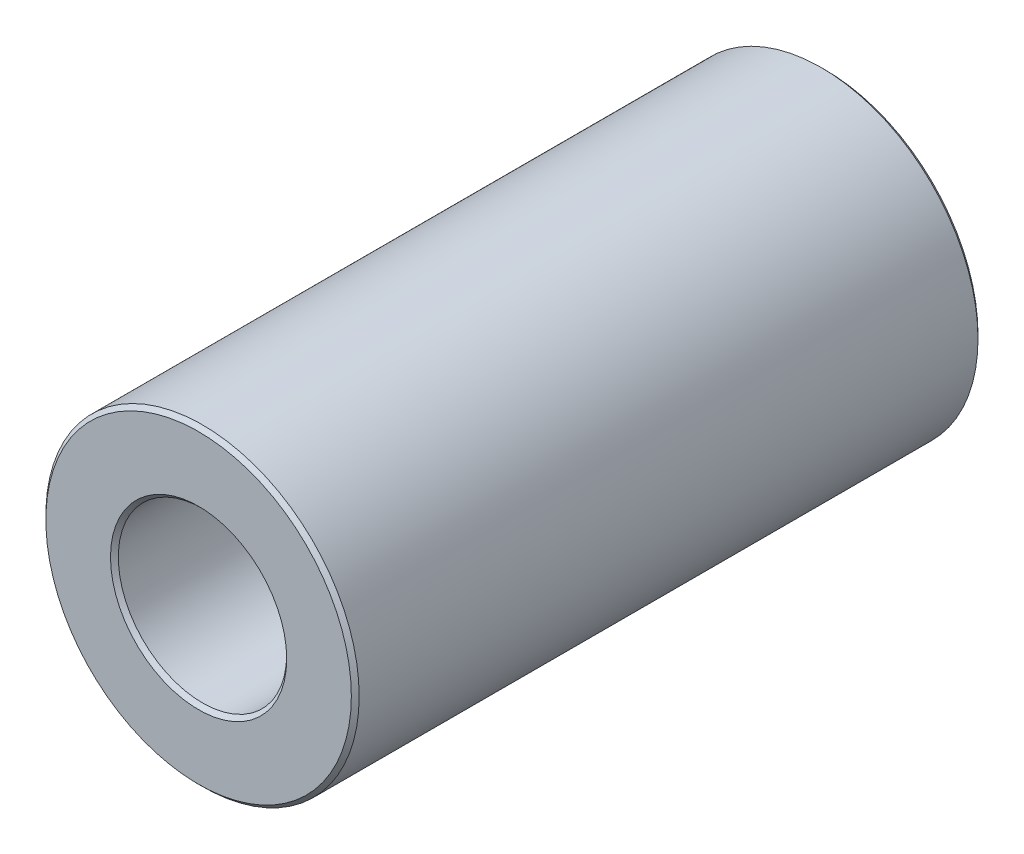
ISO-10303-21;
HEADER;
FILE_DESCRIPTION(('STEP AP214'),'2;1');
FILE_NAME('part.step','',(''),(''),'','','');
FILE_SCHEMA(('AUTOMOTIVE_DESIGN { 1 0 10303 214 1 1 1 1 }'));
ENDSEC;
DATA;
#1=APPLICATION_CONTEXT('core data for automotive mechanical design processes');
#2=APPLICATION_PROTOCOL_DEFINITION('international standard','automotive_design',2000,#1);
#3=PRODUCT_CONTEXT('',#1,'mechanical');
#4=PRODUCT('Part','Part','',(#3));
#5=PRODUCT_RELATED_PRODUCT_CATEGORY('part','',(#4));
#6=PRODUCT_DEFINITION_FORMATION('','',#4);
#7=PRODUCT_DEFINITION_CONTEXT('part definition',#1,'design');
#8=PRODUCT_DEFINITION('design','',#6,#7);
#9=PRODUCT_DEFINITION_SHAPE('','',#8);
#10=(LENGTH_UNIT() NAMED_UNIT(*) SI_UNIT(.MILLI.,.METRE.));
#11=(NAMED_UNIT(*) PLANE_ANGLE_UNIT() SI_UNIT($,.RADIAN.));
#12=(NAMED_UNIT(*) SI_UNIT($,.STERADIAN.) SOLID_ANGLE_UNIT());
#13=UNCERTAINTY_MEASURE_WITH_UNIT(LENGTH_MEASURE(1.E-05),#10,'distance_accuracy_value','');
#14=(GEOMETRIC_REPRESENTATION_CONTEXT(3) GLOBAL_UNCERTAINTY_ASSIGNED_CONTEXT((#13)) GLOBAL_UNIT_ASSIGNED_CONTEXT((#10,
#11,#12)) REPRESENTATION_CONTEXT('',''));
#15=CARTESIAN_POINT('',(0.,0.,0.));
#16=DIRECTION('',(0.,0.,1.));
#17=DIRECTION('',(1.,0.,0.));
#18=AXIS2_PLACEMENT_3D('',#15,#16,#17);
#19=CARTESIAN_POINT('',(0.,0.,8.));
#20=DIRECTION('',(0.,0.,1.));
#21=DIRECTION('',(1.,0.,0.));
#22=AXIS2_PLACEMENT_3D('',#19,#20,#21);
#23=PLANE('',#22);
#24=CARTESIAN_POINT('',(0.,0.,8.));
#25=DIRECTION('',(0.,0.,1.));
#26=DIRECTION('',(1.,0.,0.));
#27=AXIS2_PLACEMENT_3D('',#24,#25,#26);
#28=CIRCLE('',#27,2.25);
#29=CARTESIAN_POINT('',(2.25,0.,8.));
#30=VERTEX_POINT('',#29);
#31=EDGE_CURVE('E10',#30,#30,#28,.F.);
#32=ORIENTED_EDGE('',*,*,#31,.T.);
#33=EDGE_LOOP('',(#32));
#34=FACE_BOUND('',#33,.T.);
#35=CARTESIAN_POINT('',(0.,0.,8.));
#36=DIRECTION('',(0.,0.,1.));
#37=DIRECTION('',(1.,0.,0.));
#38=AXIS2_PLACEMENT_3D('',#35,#36,#37);
#39=CIRCLE('',#38,3.9);
#40=CARTESIAN_POINT('',(3.9,0.,8.));
#41=VERTEX_POINT('',#40);
#42=EDGE_CURVE('E45',#41,#41,#39,.T.);
#43=ORIENTED_EDGE('',*,*,#42,.T.);
#44=EDGE_LOOP('',(#43));
#45=FACE_BOUND('',#44,.T.);
#46=ADVANCED_FACE('F37',(#34,#45),#23,.T.);
#47=CARTESIAN_POINT('',(0.,0.,-8.));
#48=DIRECTION('',(0.,0.,1.));
#49=DIRECTION('',(1.,0.,0.));
#50=AXIS2_PLACEMENT_3D('',#47,#48,#49);
#51=PLANE('',#50);
#52=CARTESIAN_POINT('',(0.,0.,-8.));
#53=DIRECTION('',(0.,0.,1.));
#54=DIRECTION('',(1.,0.,0.));
#55=AXIS2_PLACEMENT_3D('',#52,#53,#54);
#56=CIRCLE('',#55,3.9);
#57=CARTESIAN_POINT('',(3.9,0.,-8.));
#58=VERTEX_POINT('',#57);
#59=EDGE_CURVE('E64',#58,#58,#56,.F.);
#60=ORIENTED_EDGE('',*,*,#59,.T.);
#61=EDGE_LOOP('',(#60));
#62=FACE_BOUND('',#61,.T.);
#63=CARTESIAN_POINT('',(0.,0.,-8.));
#64=DIRECTION('',(0.,0.,1.));
#65=DIRECTION('',(1.,0.,0.));
#66=AXIS2_PLACEMENT_3D('',#63,#64,#65);
#67=CIRCLE('',#66,2.25);
#68=CARTESIAN_POINT('',(2.25,0.,-8.));
#69=VERTEX_POINT('',#68);
#70=EDGE_CURVE('E67',#69,#69,#67,.T.);
#71=ORIENTED_EDGE('',*,*,#70,.T.);
#72=EDGE_LOOP('',(#71));
#73=FACE_BOUND('',#72,.T.);
#74=ADVANCED_FACE('F89',(#62,#73),#51,.F.);
#75=CARTESIAN_POINT('',(0.,0.,8.));
#76=DIRECTION('',(0.,0.,-1.));
#77=DIRECTION('',(-1.,0.,0.));
#78=AXIS2_PLACEMENT_3D('',#75,#76,#77);
#79=CYLINDRICAL_SURFACE('',#78,4.);
#80=CARTESIAN_POINT('',(0.,0.,-7.9));
#81=DIRECTION('',(0.,0.,1.));
#82=DIRECTION('',(1.,0.,0.));
#83=AXIS2_PLACEMENT_3D('',#80,#81,#82);
#84=CIRCLE('',#83,4.);
#85=CARTESIAN_POINT('',(4.,0.,-7.9));
#86=VERTEX_POINT('',#85);
#87=EDGE_CURVE('E71',#86,#86,#84,.T.);
#88=ORIENTED_EDGE('',*,*,#87,.T.);
#89=EDGE_LOOP('',(#88));
#90=FACE_BOUND('',#89,.T.);
#91=CARTESIAN_POINT('',(0.,0.,7.9));
#92=DIRECTION('',(0.,0.,1.));
#93=DIRECTION('',(1.,0.,0.));
#94=AXIS2_PLACEMENT_3D('',#91,#92,#93);
#95=CIRCLE('',#94,4.);
#96=CARTESIAN_POINT('',(4.,0.,7.9));
#97=VERTEX_POINT('',#96);
#98=EDGE_CURVE('E74',#97,#97,#95,.F.);
#99=ORIENTED_EDGE('',*,*,#98,.T.);
#100=EDGE_LOOP('',(#99));
#101=FACE_BOUND('',#100,.T.);
#102=ADVANCED_FACE('F78',(#90,#101),#79,.T.);
#103=CARTESIAN_POINT('',(0.,0.,8.));
#104=DIRECTION('',(0.,0.,-1.));
#105=DIRECTION('',(-1.,0.,0.));
#106=AXIS2_PLACEMENT_3D('',#103,#104,#105);
#107=CYLINDRICAL_SURFACE('',#106,2.15);
#108=CARTESIAN_POINT('',(0.,0.,-7.9));
#109=DIRECTION('',(0.,0.,1.));
#110=DIRECTION('',(1.,0.,0.));
#111=AXIS2_PLACEMENT_3D('',#108,#109,#110);
#112=CIRCLE('',#111,2.15);
#113=CARTESIAN_POINT('',(2.15,0.,-7.9));
#114=VERTEX_POINT('',#113);
#115=EDGE_CURVE('E51',#114,#114,#112,.F.);
#116=ORIENTED_EDGE('',*,*,#115,.T.);
#117=EDGE_LOOP('',(#116));
#118=FACE_BOUND('',#117,.T.);
#119=CARTESIAN_POINT('',(0.,0.,7.9));
#120=DIRECTION('',(0.,0.,1.));
#121=DIRECTION('',(1.,0.,0.));
#122=AXIS2_PLACEMENT_3D('',#119,#120,#121);
#123=CIRCLE('',#122,2.15);
#124=CARTESIAN_POINT('',(2.15,0.,7.9));
#125=VERTEX_POINT('',#124);
#126=EDGE_CURVE('E58',#125,#125,#123,.T.);
#127=ORIENTED_EDGE('',*,*,#126,.T.);
#128=EDGE_LOOP('',(#127));
#129=FACE_BOUND('',#128,.T.);
#130=ADVANCED_FACE('F97',(#118,#129),#107,.F.);
#131=CARTESIAN_POINT('',(0.,0.,-7.9));
#132=DIRECTION('',(0.,0.,1.));
#133=DIRECTION('',(1.,0.,0.));
#134=AXIS2_PLACEMENT_3D('',#131,#132,#133);
#135=CONICAL_SURFACE('',#134,4.,0.785398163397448);
#136=ORIENTED_EDGE('',*,*,#59,.F.);
#137=EDGE_LOOP('',(#136));
#138=FACE_BOUND('',#137,.T.);
#139=ORIENTED_EDGE('',*,*,#87,.F.);
#140=EDGE_LOOP('',(#139));
#141=FACE_BOUND('',#140,.T.);
#142=ADVANCED_FACE('F102',(#138,#141),#135,.T.);
#143=CARTESIAN_POINT('',(0.,0.,-8.));
#144=DIRECTION('',(0.,0.,-1.));
#145=DIRECTION('',(-1.,0.,0.));
#146=AXIS2_PLACEMENT_3D('',#143,#144,#145);
#147=CONICAL_SURFACE('',#146,2.25,0.785398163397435);
#148=ORIENTED_EDGE('',*,*,#115,.F.);
#149=EDGE_LOOP('',(#148));
#150=FACE_BOUND('',#149,.T.);
#151=ORIENTED_EDGE('',*,*,#70,.F.);
#152=EDGE_LOOP('',(#151));
#153=FACE_BOUND('',#152,.T.);
#154=ADVANCED_FACE('F86',(#150,#153),#147,.F.);
#155=CARTESIAN_POINT('',(0.,0.,7.9));
#156=DIRECTION('',(0.,0.,1.));
#157=DIRECTION('',(1.,0.,0.));
#158=AXIS2_PLACEMENT_3D('',#155,#156,#157);
#159=CONICAL_SURFACE('',#158,2.15,0.785398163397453);
#160=ORIENTED_EDGE('',*,*,#31,.F.);
#161=EDGE_LOOP('',(#160));
#162=FACE_BOUND('',#161,.T.);
#163=ORIENTED_EDGE('',*,*,#126,.F.);
#164=EDGE_LOOP('',(#163));
#165=FACE_BOUND('',#164,.T.);
#166=ADVANCED_FACE('F82',(#162,#165),#159,.F.);
#167=CARTESIAN_POINT('',(0.,0.,8.));
#168=DIRECTION('',(0.,0.,-1.));
#169=DIRECTION('',(-1.,0.,0.));
#170=AXIS2_PLACEMENT_3D('',#167,#168,#169);
#171=CONICAL_SURFACE('',#170,3.9,0.785398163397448);
#172=ORIENTED_EDGE('',*,*,#98,.F.);
#173=EDGE_LOOP('',(#172));
#174=FACE_BOUND('',#173,.T.);
#175=ORIENTED_EDGE('',*,*,#42,.F.);
#176=EDGE_LOOP('',(#175));
#177=FACE_BOUND('',#176,.T.);
#178=ADVANCED_FACE('F39',(#174,#177),#171,.T.);
#179=CLOSED_SHELL('',(#46,#74,#102,#130,#142,#154,#166,#178));
#180=MANIFOLD_SOLID_BREP('B2',#179);
#181=ADVANCED_BREP_SHAPE_REPRESENTATION('',(#18,#180),#14);
#182=SHAPE_DEFINITION_REPRESENTATION(#9,#181);
ENDSEC;
END-ISO-10303-21;
